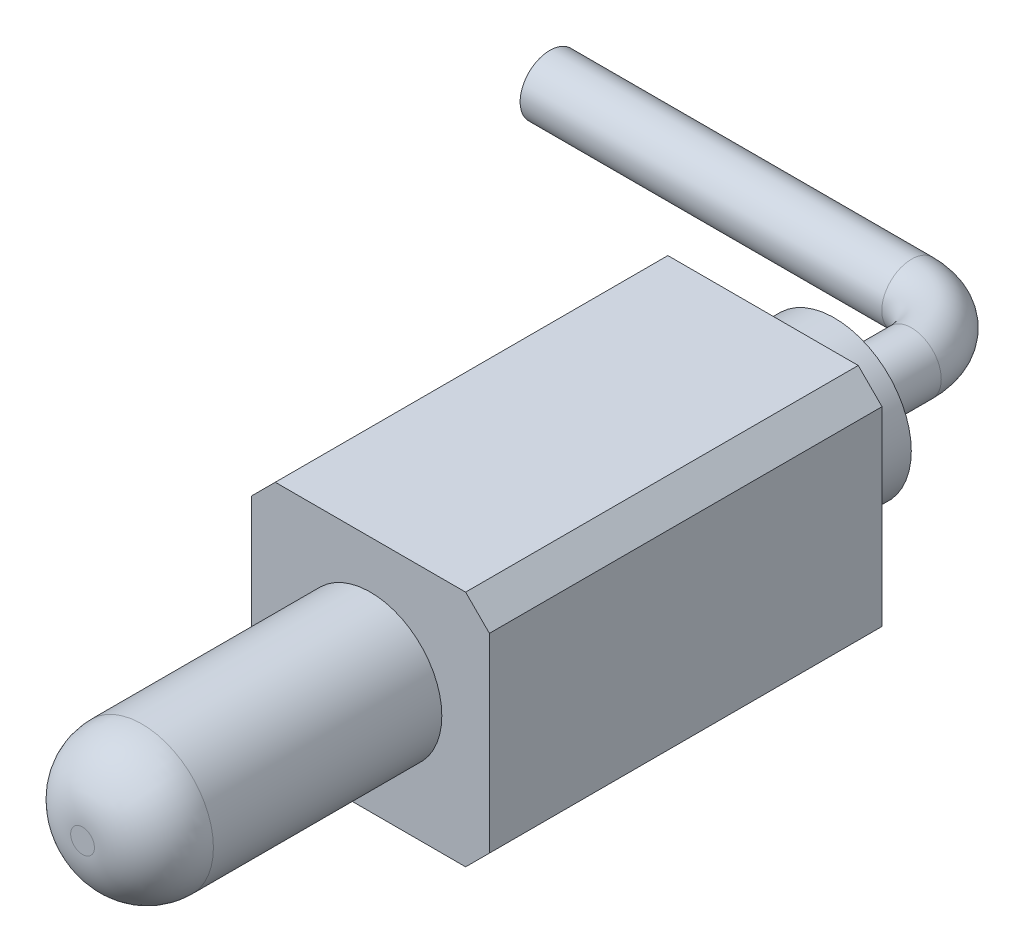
from build123d import *

# Parameters (mm, degrees)
BOSS_EXTRUDE1_DEPTH = 4.191
SKETCH2_R           = 0.762
BOSS_EXTRUDE2_DEPTH = 3.0734
FILLET2_R           = 0.635
SKETCH3_R           = 0.3175
BOSS_EXTRUDE3_DEPTH = 3.2258
SKETCH4_R           = 0.820584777
BOSS_EXTRUDE4_DEPTH = 0.762
SKETCH5_R           = 0.3175


with BuildPart() as part:
    # Sketch1 → Boss-Extrude1 (new body)
    with BuildSketch(Plane.XY):
        Polygon((2.286, 2.54), (2.54, 2.286), (2.54, 0.254), (2.286, 0), (0.254, 0), (0, 0.254), (0, 2.286), (0.254, 2.54), align=None)
    extrude(amount=BOSS_EXTRUDE1_DEPTH)

    # Sketch2 → Boss-Extrude2 (add)
    with BuildSketch(Plane.XY.offset(4.191)):
        with Locations((1.27, 1.27)):
            Circle(SKETCH2_R)
    extrude(amount=BOSS_EXTRUDE2_DEPTH)

    # Fillet2
    fillet2_edges = [part.edges().sort_by_distance(p)[0] for p in [
        (0.508, 1.27, 7.2644),
    ]]
    fillet(fillet2_edges, radius=FILLET2_R)

    # Sketch4 → Boss-Extrude4 (add)
    with BuildSketch(Plane(origin=(0, 0, 0), x_dir=(-1, 0, 0), z_dir=(0, 0, -1))):
        with Locations(Location((-1.27, 1.27, 0), (0, 0, 180))):
            Circle(SKETCH4_R)
    extrude(amount=BOSS_EXTRUDE4_DEPTH)



with BuildPart() as body_2:
    # Sketch3 → Boss-Extrude3 (new body)
    with BuildSketch(Plane.ZY):
        with Locations((-2.220068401, 1.27)):
            Circle(SKETCH3_R)
    extrude(amount=BOSS_EXTRUDE3_DEPTH)


with BuildPart() as part_1:
    add(part.part)

    add(body_2.part)  # Sweep1 merges body 2
    # Sweep1: sweep along a curve in space
    with BuildLine() as sweep1_path:
        Line((0, 1.27, -2.220068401), (0.635, 1.27, -2.220068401))
        ThreePointArc((0.635, 1.27, -2.220068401), (1.084012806, 1.27, -2.034081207), (1.27, 1.27, -1.585068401))
        Line((1.27, 1.27, -1.585068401), (1.27, 1.27, -0.762))
    # Sketch5 → Sweep1 (sweep)
    with BuildSketch(Plane(origin=(0, 0, 0), x_dir=(0, 0, -1), z_dir=(1, 0, 0))):
        with Locations((2.220068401, 1.27)):
            Circle(SKETCH5_R)
    sweep(path=sweep1_path.line)


solid = part_1.part
